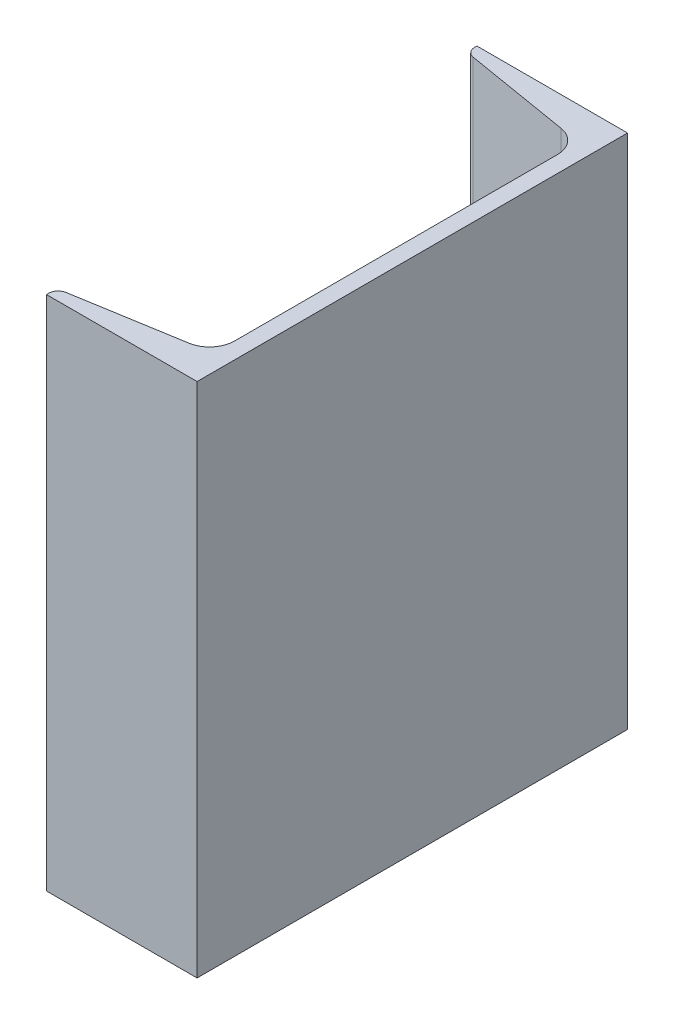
from build123d import *

# Parameters (mm, degrees)
AL_CHANNEL_STANDARD_C5X2_32_1_DEPTH = 152.4


with BuildPart() as part:
    # Sketch12 → Al channel _standard_ C5X2.32_1 (new body)
    with BuildSketch(Plane(origin=(0, 0, 0), x_dir=(-1, 0, 0), z_dir=(0, 1, 0))):
        with BuildLine():
            Line((0, 0), (0, 127))
            Line((0, 127), (44.45, 127))
            Line((44.45, 127), (44.45, 126.33618976))
            ThreePointArc((44.45, 126.33618976), (43.787888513, 124.53023091), (42.115363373, 123.58021057))
            Line((42.115363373, 123.58021057), (10.980951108, 118.390763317))
            ThreePointArc((10.980951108, 118.390763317), (6.571566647, 115.886164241), (4.826, 111.125))
            Line((4.826, 111.125), (4.826, 15.875))
            ThreePointArc((4.826, 15.875), (6.571566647, 11.113835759), (10.980951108, 8.609236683))
            Line((10.980951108, 8.609236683), (42.115363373, 3.41978943))
            ThreePointArc((42.115363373, 3.41978943), (43.787888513, 2.46976909), (44.45, 0.66381024))
            Line((44.45, 0.66381024), (44.45, 0))
            Line((44.45, 0), (0, 0))
        make_face()
    extrude(amount=AL_CHANNEL_STANDARD_C5X2_32_1_DEPTH)


solid = part.part
